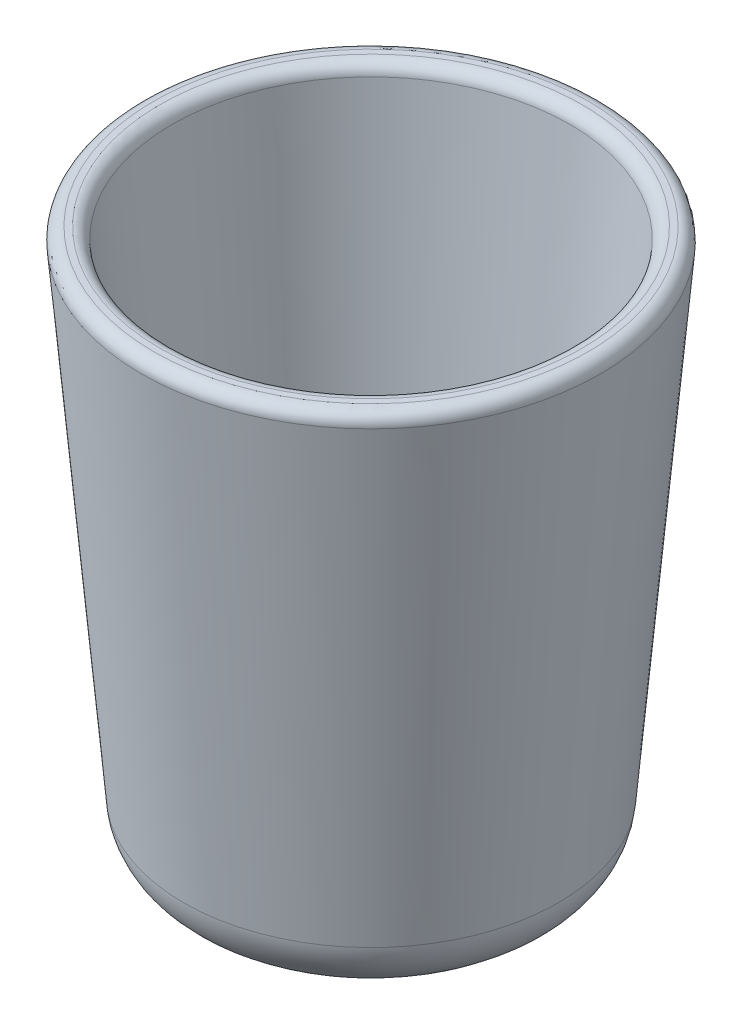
from build123d import *

# Parameters (mm, degrees)
SKETCH1_R          = 38.1
BASE_EXTRUDE_DEPTH = 114.3
BASE_EXTRUDE_DRAFT = -5
FILLET1_R          = 12.7
SHELL1_T           = -6.35
FILLET2_R          = 2.54


with BuildPart() as part:
    # Sketch1 → Base-Extrude (with draft: the straight prism first)
    with BuildSketch(Plane(origin=(0, 0, 0), x_dir=(1, 0, 0), z_dir=(0, 1, 0))):
        Circle(SKETCH1_R)
    extrude(amount=BASE_EXTRUDE_DEPTH)
    # Base-Extrude: the draft: its side faces are tilted about the plane it starts from
    base_extrude_sides = [part.faces().sort_by_distance(p)[0] for p in [
        (-38.1, 57.15, 0),
    ]]
    draft(base_extrude_sides, Plane(origin=(0, 0, 0), x_dir=(1, 0, 0), z_dir=(0, 1, 0)), BASE_EXTRUDE_DRAFT)

    # Fillet1
    fillet1_edges = [part.edges().sort_by_distance(p)[0] for p in [
        (-38.1, 0, 0),
    ]]
    fillet(fillet1_edges, radius=FILLET1_R)

    # Shell1
    shell1_openings = [part.faces().sort_by_distance(p)[0] for p in [
        (0, 114.3, 0),
    ]]
    offset(amount=SHELL1_T, openings=shell1_openings, kind=Kind.INTERSECTION)

    # Fillet2
    fillet2_edges = [part.edges().sort_by_distance(p)[0] for p in [
        (-48.099954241, 114.3, 0),
        (-41.725698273, 114.3, 0),
    ]]
    fillet(fillet2_edges, radius=FILLET2_R)


solid = part.part
